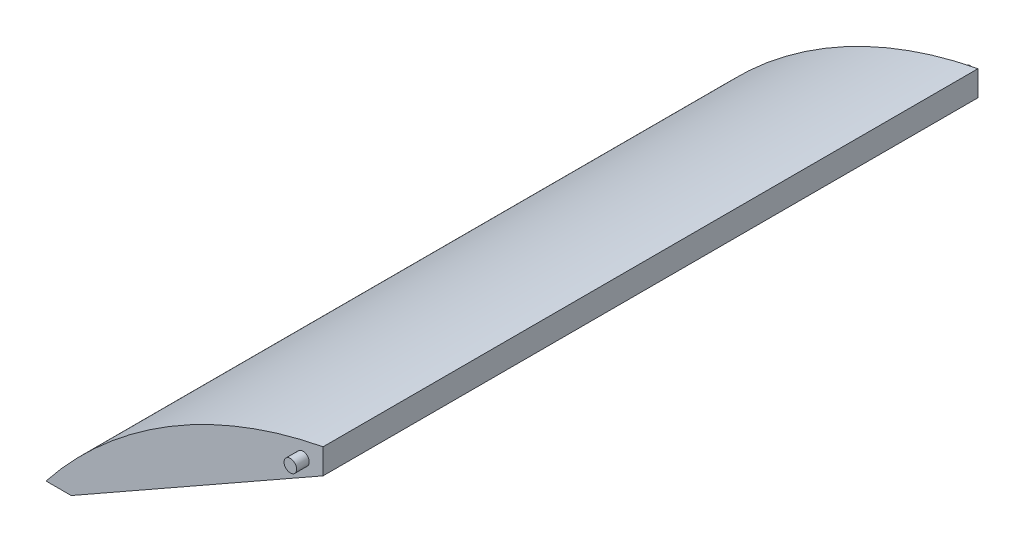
from build123d import *

# Parameters (mm, degrees)
BOSS_EXTRUDE3_DEPTH = 260
SKETCH5_W           = 35
SKETCH5_H           = 70.11
CUT_EXTRUDE1_DEPTH  = 260
CUT_EXTRUDE2_DEPTH  = 260
SKETCH8_R           = 2.5
BOSS_EXTRUDE4_DEPTH = 5


with BuildPart() as part:
    # Sketch4 → Boss-Extrude3 (new body)
    with BuildSketch(Plane.XY):
        with BuildLine():
            Line((0, 0), (145, 0))
            Line((145, 0), (145, 70.11))
            ThreePointArc((145, 70.11), (64.469862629, 51.662758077), (0, 0))
        make_face()
    extrude(amount=BOSS_EXTRUDE3_DEPTH)

    # Sketch5 → Cut-Extrude1 (cut)
    with BuildSketch(Plane.XY.offset(260)):
        with Locations((127.5, 35.055)):
            Rectangle(SKETCH5_W, SKETCH5_H)
    extrude(amount=-CUT_EXTRUDE1_DEPTH, mode=Mode.SUBTRACT)

    # Sketch6 → Cut-Extrude2 (cut)
    with BuildSketch(Plane.XY.offset(260)):
        Polygon((110, 0), (10, 0), (110, 56.768983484), align=None)
    extrude(amount=-CUT_EXTRUDE2_DEPTH, mode=Mode.SUBTRACT)

    # Sketch8 → Boss-Extrude4 (add)
    with BuildSketch(Plane.XY.offset(260)):
        with Locations((102, 58.768983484)):
            Circle(SKETCH8_R)
    boss_extrude4 = extrude(amount=BOSS_EXTRUDE4_DEPTH)

    # Mirror2: Boss-Extrude4 across plane
    add(boss_extrude4.mirror(Plane.XY.offset(130)))


solid = part.part
